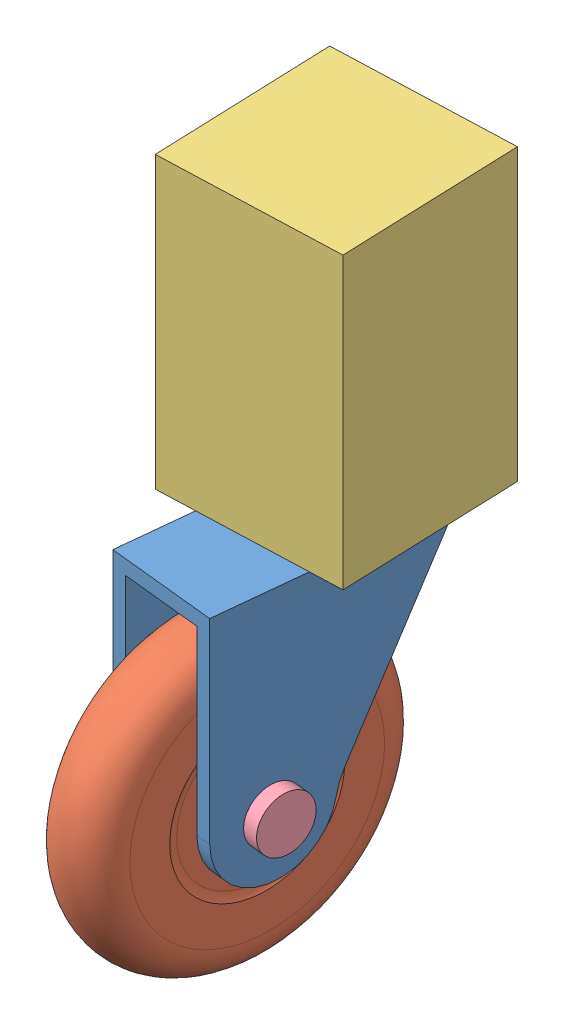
SolidWorks assembly caster wheel.SLDASM, configuration Default (file format 7000). Lengths in mm.
Overall size (32.89 121.56 68.8).
4 component instances, 4 part files, 6 mates.
Components (placement in the parent):
- casing of wheel-1: casing of wheel.SLDPRT [Default] at (-9.8074 0 8.8425) x (-0.103192 0 0.994661) z (-0.994661 0 -0.103192) size (40.64 87.37 25.4)
- wheel-1: wheel.SLDPRT [Default] at (-17.0409 -31.75 17.0298) x (0.994661 0 0.103192) z (-0.033747 0.945013 0.325288) size (12.7 53.34 53.34)
- plug-1: plug.SLDPRT [Default] at (-8.89 5.08 0) x (0.999326 0 -0.036697) z (0.036697 0 0.999326) size (31.75 50.8 31.75)
- bolt-1: bolt.SLDPRT [Default] at (-1.2506 -31.75 18.668) x (-0.096383 0.357225 0.929032) z (-0.036863 -0.934018 0.355318) size (9.53 24.13 9.53)
Mates (geometry in assembly coordinates):
- Distance2: distance = 0.635 mm anti-aligned: plane of wheel-1 through (-2.4271 -25.1047 -0.7598) normal (0.994661 0 0.103192); plane of casing of wheel-1 through (-3.777 -31.75 18.4059) normal (-0.994661 0 -0.103192)
- Concentric2: concentric aligned: cylinder of casing of wheel-1 through (1.9074 -31.75 18.9956) axis (-0.994661 0 -0.103192) radius 3.175; cylinder of wheel-1 through (-4.4087 -31.75 18.3404) axis (-0.994661 0 -0.103192) radius 3.175
- Concentric4: concentric aligned: cylinder of casing of wheel-1 through (-8.89 43.18 0) axis (0 -1 0) radius 4.7625; cylinder of plug-1 through (-8.89 43.18 0) axis (0 -1 0) radius 4.7625
- Coincident4: coincident anti-aligned: plane of casing of wheel-1 through (-8.89 5.08 0) normal (0 1 0); plane of plug-1 through (-8.89 5.08 0) normal (0 -1 0)
- Concentric17: concentric anti-aligned: cylinder of casing of wheel-1 through (1.9074 -31.75 18.9956) axis (-0.994661 0 -0.103192) radius 3.175; cylinder of bolt-1 through (-21.4621 -31.75 16.5711) axis (0.994661 0 0.103192) radius 3.175
- Coincident18: coincident anti-aligned: plane of casing of wheel-1 through (1.6326 2.54 -9.1229) normal (0.994661 0 0.103192); plane of bolt-1 through (-1.2506 -31.75 18.668) normal (-0.994661 0 -0.103192)
